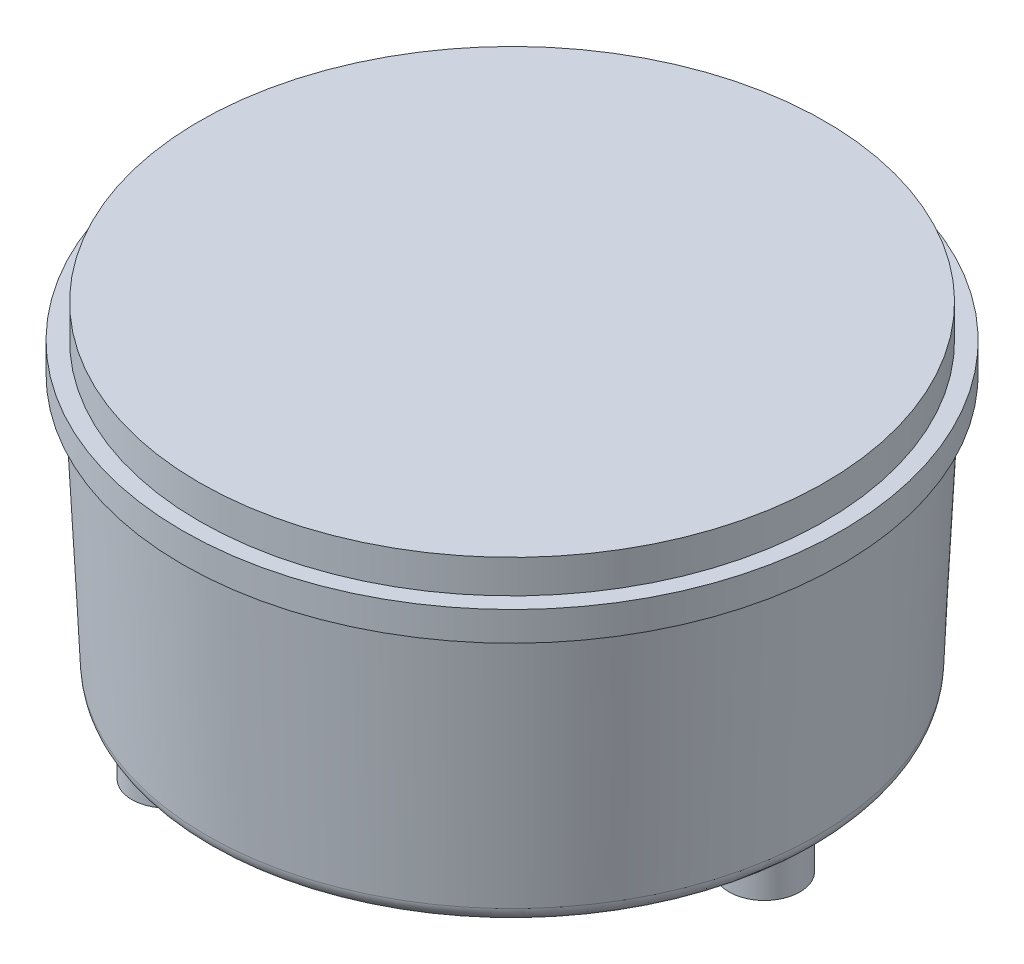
from build123d import *

# Parameters (mm, degrees)
ESQUISSE2_R      = 4.25
ESQUISSE2_R_2    = 1.5
EXTRUSION1_DEPTH = 5
CONG_1_R         = 1


with BuildPart() as part:
    # Esquisse1 → R_volution2 (revolve)
    with BuildSketch(Plane.XY, mode=Mode.PRIVATE) as r_volution2_sk:
        with BuildLine():
            Line((0, 4), (-37.5, 4))
            Line((-37.5, 4), (-37.5, 0))
            Line((-37.5, 0), (-39.5, 0))
            Line((-39.5, 0), (-39.5, -3.5))
            Line((-39.5, -3.5), (-38.953514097, -3.5))
            ThreePointArc((-38.953514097, -3.5), (-38.263429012, -3.776271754), (-37.954645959, -4.452434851))
            Line((-37.954645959, -4.452434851), (-36.590708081, -33.095130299))
            ThreePointArc((-36.590708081, -33.095130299), (-35.973141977, -34.447456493), (-34.592971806, -35))
            Line((-34.592971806, -35), (0, -35))
            Line((0, -35), (0, 4))
        make_face()
    revolve(r_volution2_sk.sketch.rotate(Axis((0, 17.919124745, 0), (0, -1, 0)), 270), axis=Axis((0, 17.919124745, 0), (0, -1, 0)))

    # Esquisse2 → Extrusion1 (add)
    # profile 1 of 3: a face of its own
    with BuildSketch(Plane.XZ.offset(35)):
        with Locations(Location((30.25, 0, 0), (0, 0, 270))):
            Circle(ESQUISSE2_R)
        with Locations(Location((30.25, 0, 0), (0, 0, 270))):
            Circle(ESQUISSE2_R_2, mode=Mode.SUBTRACT)
    # profile 2 of 3: a face of its own
    with BuildSketch(Plane.XZ.offset(35)):
        with Locations(Location((-15.125, 26.197268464, 0), (0, 0, 270))):
            Circle(ESQUISSE2_R)
        with Locations(Location((-15.125, 26.197268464, 0), (0, 0, 270))):
            Circle(ESQUISSE2_R_2, mode=Mode.SUBTRACT)
    # profile 3 of 3: a face of its own
    with BuildSketch(Plane.XZ.offset(35)):
        with Locations(Location((-15.125, -26.197268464, 0), (0, 0, 270))):
            Circle(ESQUISSE2_R)
        with Locations(Location((-15.125, -26.197268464, 0), (0, 0, 270))):
            Circle(ESQUISSE2_R_2, mode=Mode.SUBTRACT)
    extrude(amount=EXTRUSION1_DEPTH)

    # Cong_1
    cong_1_edges = [part.edges().sort_by_distance(p)[0] for p in [
        (30.25, -35, 4.25),
        (-15.125, -35, 30.447268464),
        (-15.125, -35, -21.947268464),
    ]]
    fillet(cong_1_edges, radius=CONG_1_R)


solid = part.part
